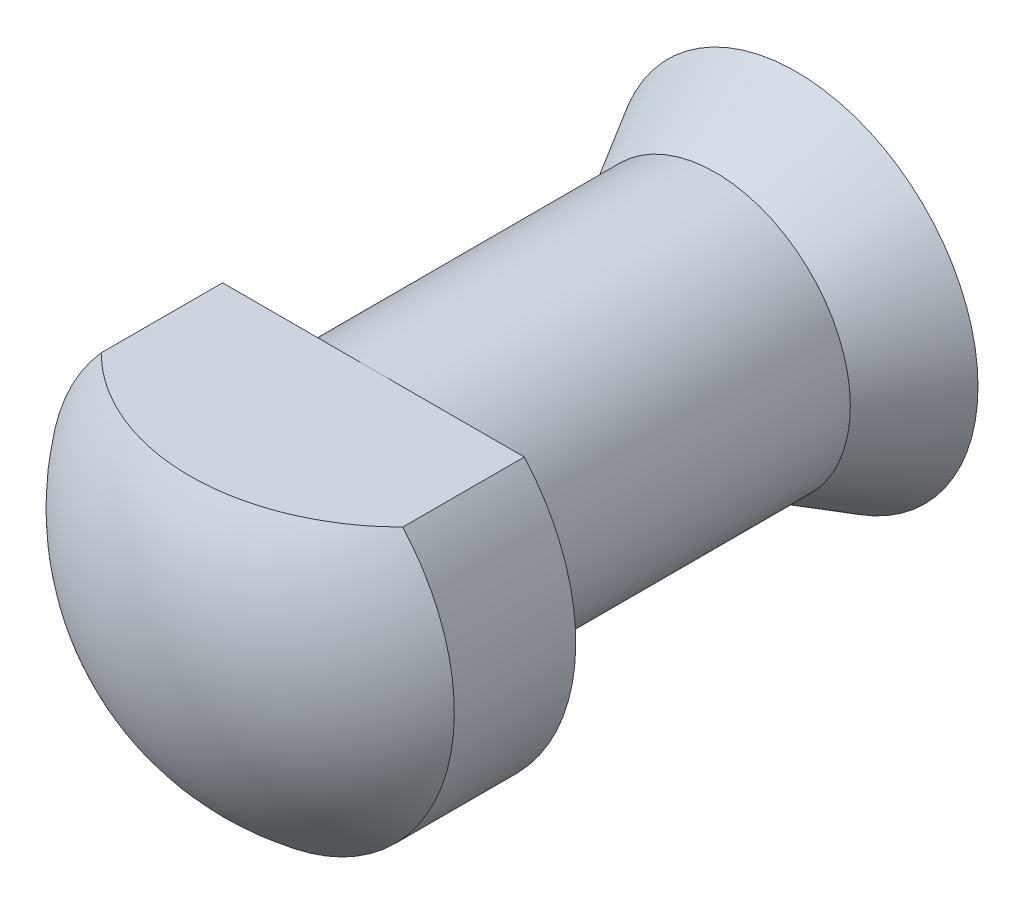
from build123d import *

# Parameters (mm, degrees)
SKETCH_2_W          = 7.62
SKETCH_2_H          = 1.27
CUT_EXTRUDE_1_DEPTH = 11.45745626


with BuildPart() as part:
    # Sketch 1 → Revolve 1 (revolve)
    with BuildSketch(Plane(origin=(0, 0, 0), x_dir=(0, 0, -1), z_dir=(1, 0, 0)), mode=Mode.PRIVATE) as revolve_1_sk:
        with BuildLine():
            Line((0, 0), (13.153488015, 0))
            ThreePointArc((13.153488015, 0), (12.898470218, -1.781485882), (12.1539, -3.41988181))
            Line((12.1539, -3.41988181), (10.6299, -2.54))
            Line((10.6299, -2.54), (4.191, -2.54))
            Line((4.191, -2.54), (4.191, -3.81))
            Line((4.191, -3.81), (1.905, -3.81))
            ThreePointArc((1.905, -3.81), (0.502790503, -2.129854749), (0, 0))
        make_face()
    revolve(revolve_1_sk.sketch.rotate(Axis((0, 0, 0), (0, 0, -1)), 270), axis=Axis((0, 0, 0), (0, 0, -1)))

    # Sketch 2 → Cut-Extrude 1 (cut, through all)
    with BuildSketch(Plane(origin=(0, 0, -4.191), x_dir=(-1, 0, 0), z_dir=(0, 0, -1))):
        with Locations((0, 3.175)):
            Rectangle(SKETCH_2_W, SKETCH_2_H)
    extrude(amount=-CUT_EXTRUDE_1_DEPTH, mode=Mode.SUBTRACT)


solid = part.part
